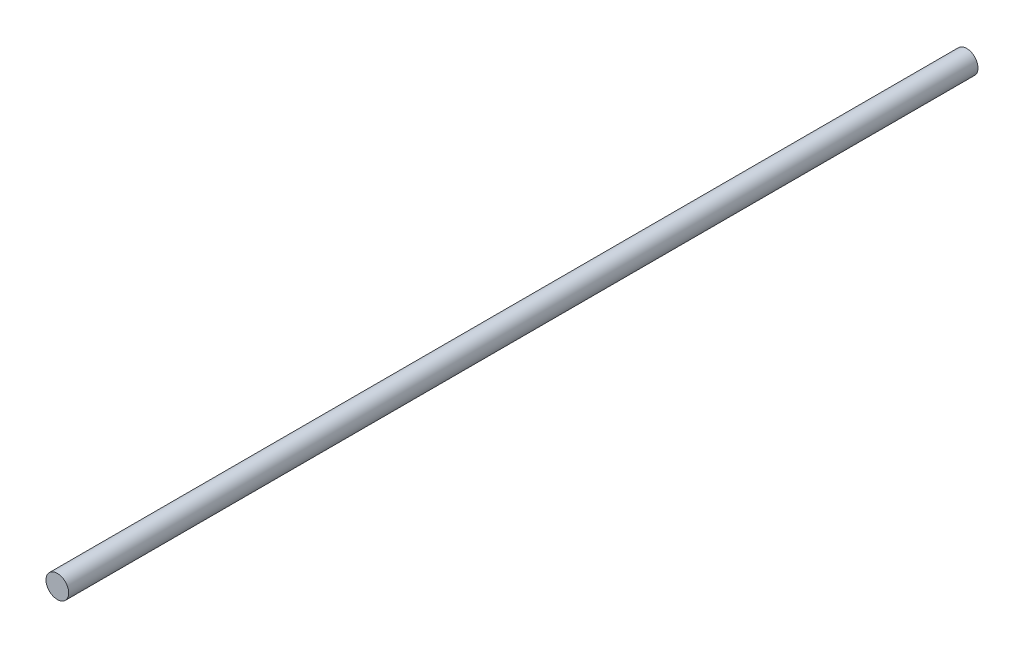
ISO-10303-21;
HEADER;
FILE_DESCRIPTION(('STEP AP214'),'2;1');
FILE_NAME('part.step','',(''),(''),'','','');
FILE_SCHEMA(('AUTOMOTIVE_DESIGN { 1 0 10303 214 1 1 1 1 }'));
ENDSEC;
DATA;
#1=APPLICATION_CONTEXT('core data for automotive mechanical design processes');
#2=APPLICATION_PROTOCOL_DEFINITION('international standard','automotive_design',2000,#1);
#3=PRODUCT_CONTEXT('',#1,'mechanical');
#4=PRODUCT('Part','Part','',(#3));
#5=PRODUCT_RELATED_PRODUCT_CATEGORY('part','',(#4));
#6=PRODUCT_DEFINITION_FORMATION('','',#4);
#7=PRODUCT_DEFINITION_CONTEXT('part definition',#1,'design');
#8=PRODUCT_DEFINITION('design','',#6,#7);
#9=PRODUCT_DEFINITION_SHAPE('','',#8);
#10=(LENGTH_UNIT() NAMED_UNIT(*) SI_UNIT(.MILLI.,.METRE.));
#11=(NAMED_UNIT(*) PLANE_ANGLE_UNIT() SI_UNIT($,.RADIAN.));
#12=(NAMED_UNIT(*) SI_UNIT($,.STERADIAN.) SOLID_ANGLE_UNIT());
#13=UNCERTAINTY_MEASURE_WITH_UNIT(LENGTH_MEASURE(1.E-05),#10,'distance_accuracy_value','');
#14=(GEOMETRIC_REPRESENTATION_CONTEXT(3) GLOBAL_UNCERTAINTY_ASSIGNED_CONTEXT((#13)) GLOBAL_UNIT_ASSIGNED_CONTEXT((#10,
#11,#12)) REPRESENTATION_CONTEXT('',''));
#15=CARTESIAN_POINT('',(0.,0.,0.));
#16=DIRECTION('',(0.,0.,1.));
#17=DIRECTION('',(1.,0.,0.));
#18=AXIS2_PLACEMENT_3D('',#15,#16,#17);
#19=CARTESIAN_POINT('',(0.,0.,-2400.));
#20=DIRECTION('',(0.,0.,1.));
#21=DIRECTION('',(1.,0.,0.));
#22=AXIS2_PLACEMENT_3D('',#19,#20,#21);
#23=CYLINDRICAL_SURFACE('',#22,30.);
#24=CARTESIAN_POINT('',(0.,0.,-2400.));
#25=DIRECTION('',(0.,0.,1.));
#26=DIRECTION('',(1.,0.,0.));
#27=AXIS2_PLACEMENT_3D('',#24,#25,#26);
#28=CIRCLE('',#27,30.);
#29=CARTESIAN_POINT('',(30.,0.,-2400.));
#30=VERTEX_POINT('',#29);
#31=EDGE_CURVE('E10',#30,#30,#28,.T.);
#32=ORIENTED_EDGE('',*,*,#31,.T.);
#33=EDGE_LOOP('',(#32));
#34=FACE_BOUND('',#33,.T.);
#35=CARTESIAN_POINT('',(0.,0.,0.));
#36=DIRECTION('',(0.,0.,1.));
#37=DIRECTION('',(1.,0.,0.));
#38=AXIS2_PLACEMENT_3D('',#35,#36,#37);
#39=CIRCLE('',#38,30.);
#40=CARTESIAN_POINT('',(30.,0.,0.));
#41=VERTEX_POINT('',#40);
#42=EDGE_CURVE('E40',#41,#41,#39,.T.);
#43=ORIENTED_EDGE('',*,*,#42,.F.);
#44=EDGE_LOOP('',(#43));
#45=FACE_BOUND('',#44,.T.);
#46=ADVANCED_FACE('F37',(#34,#45),#23,.T.);
#47=CARTESIAN_POINT('',(0.,0.,-2400.));
#48=DIRECTION('',(0.,0.,1.));
#49=DIRECTION('',(1.,0.,0.));
#50=AXIS2_PLACEMENT_3D('',#47,#48,#49);
#51=PLANE('',#50);
#52=ORIENTED_EDGE('',*,*,#31,.F.);
#53=EDGE_LOOP('',(#52));
#54=FACE_BOUND('',#53,.T.);
#55=ADVANCED_FACE('F54',(#54),#51,.F.);
#56=CARTESIAN_POINT('',(0.,0.,0.));
#57=DIRECTION('',(0.,0.,1.));
#58=DIRECTION('',(1.,0.,0.));
#59=AXIS2_PLACEMENT_3D('',#56,#57,#58);
#60=PLANE('',#59);
#61=ORIENTED_EDGE('',*,*,#42,.T.);
#62=EDGE_LOOP('',(#61));
#63=FACE_BOUND('',#62,.T.);
#64=ADVANCED_FACE('F51',(#63),#60,.T.);
#65=CLOSED_SHELL('',(#46,#55,#64));
#66=MANIFOLD_SOLID_BREP('B2',#65);
#67=ADVANCED_BREP_SHAPE_REPRESENTATION('',(#18,#66),#14);
#68=SHAPE_DEFINITION_REPRESENTATION(#9,#67);
ENDSEC;
END-ISO-10303-21;
